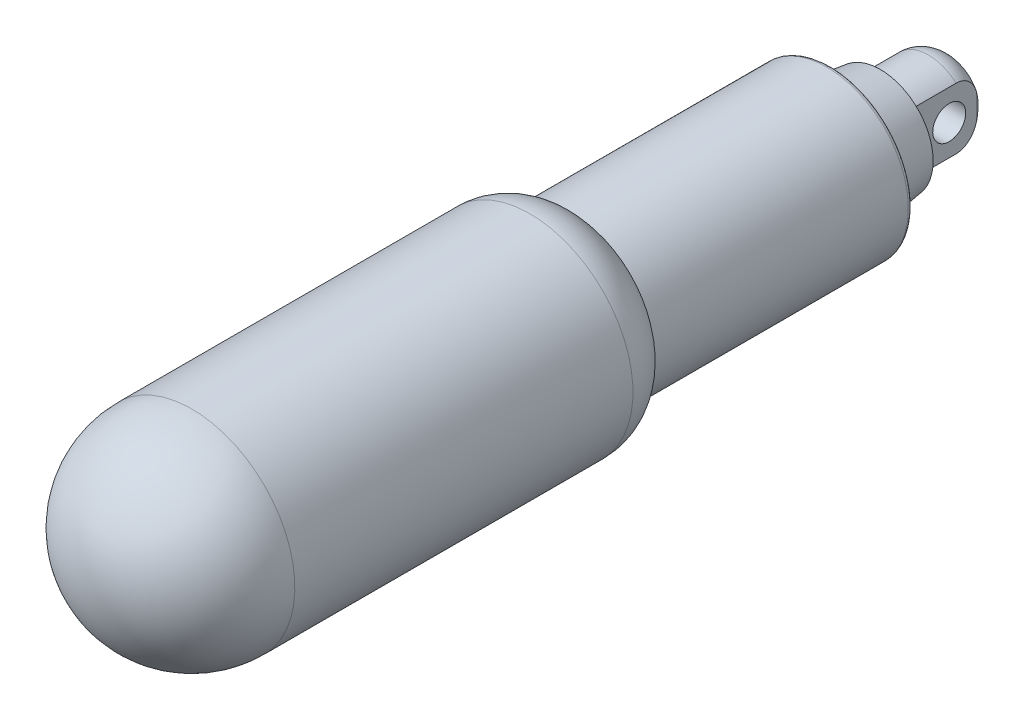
ISO-10303-21;
HEADER;
FILE_DESCRIPTION(('STEP AP214'),'2;1');
FILE_NAME('part.step','',(''),(''),'','','');
FILE_SCHEMA(('AUTOMOTIVE_DESIGN { 1 0 10303 214 1 1 1 1 }'));
ENDSEC;
DATA;
#1=APPLICATION_CONTEXT('core data for automotive mechanical design processes');
#2=APPLICATION_PROTOCOL_DEFINITION('international standard','automotive_design',2000,#1);
#3=PRODUCT_CONTEXT('',#1,'mechanical');
#4=PRODUCT('Part','Part','',(#3));
#5=PRODUCT_RELATED_PRODUCT_CATEGORY('part','',(#4));
#6=PRODUCT_DEFINITION_FORMATION('','',#4);
#7=PRODUCT_DEFINITION_CONTEXT('part definition',#1,'design');
#8=PRODUCT_DEFINITION('design','',#6,#7);
#9=PRODUCT_DEFINITION_SHAPE('','',#8);
#10=(LENGTH_UNIT() NAMED_UNIT(*) SI_UNIT(.MILLI.,.METRE.));
#11=(NAMED_UNIT(*) PLANE_ANGLE_UNIT() SI_UNIT($,.RADIAN.));
#12=(NAMED_UNIT(*) SI_UNIT($,.STERADIAN.) SOLID_ANGLE_UNIT());
#13=UNCERTAINTY_MEASURE_WITH_UNIT(LENGTH_MEASURE(1.E-05),#10,'distance_accuracy_value','');
#14=(GEOMETRIC_REPRESENTATION_CONTEXT(3) GLOBAL_UNCERTAINTY_ASSIGNED_CONTEXT((#13)) GLOBAL_UNIT_ASSIGNED_CONTEXT((#10,
#11,#12)) REPRESENTATION_CONTEXT('',''));
#15=CARTESIAN_POINT('',(0.,0.,0.));
#16=DIRECTION('',(0.,0.,1.));
#17=DIRECTION('',(1.,0.,0.));
#18=AXIS2_PLACEMENT_3D('',#15,#16,#17);
#19=CARTESIAN_POINT('',(0.,1.,-3.8333333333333));
#20=DIRECTION('',(0.,0.,-1.));
#21=DIRECTION('',(0.,1.,0.));
#22=AXIS2_PLACEMENT_3D('',#19,#20,#21);
#23=PLANE('',#22);
#24=CARTESIAN_POINT('',(0.,0.,-3.8333333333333));
#25=DIRECTION('',(0.,0.,1.));
#26=DIRECTION('',(1.,0.,0.));
#27=AXIS2_PLACEMENT_3D('',#24,#25,#26);
#28=CIRCLE('',#27,2.);
#29=CARTESIAN_POINT('',(2.,0.,-3.8333333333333));
#30=VERTEX_POINT('',#29);
#31=CARTESIAN_POINT('',(0.,2.,-3.8333333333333));
#32=VERTEX_POINT('',#31);
#33=EDGE_CURVE('E186',#30,#32,#28,.T.);
#34=ORIENTED_EDGE('',*,*,#33,.F.);
#35=CARTESIAN_POINT('',(0.,0.,-3.8333333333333));
#36=DIRECTION('',(0.,0.,1.));
#37=DIRECTION('',(-1.,0.,0.));
#38=AXIS2_PLACEMENT_3D('',#35,#36,#37);
#39=CIRCLE('',#38,2.);
#40=CARTESIAN_POINT('',(-2.,0.,-3.8333333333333));
#41=VERTEX_POINT('',#40);
#42=EDGE_CURVE('E81',#41,#30,#39,.T.);
#43=ORIENTED_EDGE('',*,*,#42,.F.);
#44=CARTESIAN_POINT('',(0.,0.,-3.8333333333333));
#45=DIRECTION('',(0.,0.,1.));
#46=DIRECTION('',(0.,1.,0.));
#47=AXIS2_PLACEMENT_3D('',#44,#45,#46);
#48=CIRCLE('',#47,2.);
#49=EDGE_CURVE('E182',#32,#41,#48,.T.);
#50=ORIENTED_EDGE('',*,*,#49,.F.);
#51=EDGE_LOOP('',(#34,#43,#50));
#52=FACE_BOUND('',#51,.T.);
#53=ADVANCED_FACE('F14',(#52),#23,.T.);
#54=CARTESIAN_POINT('',(-2.85,-12.5,-3.3333333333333));
#55=DIRECTION('',(0.,-1.,0.));
#56=DIRECTION('',(1.,0.,0.));
#57=AXIS2_PLACEMENT_3D('',#54,#55,#56);
#58=CYLINDRICAL_SURFACE('',#57,0.5);
#59=DIRECTION('',(0.,1.,0.));
#60=VECTOR('',#59,1.);
#61=CARTESIAN_POINT('',(-3.35,-12.5,-3.3333333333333));
#62=LINE('',#61,#60);
#63=CARTESIAN_POINT('',(-3.35,-1.46994883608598,-3.3333333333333));
#64=VERTEX_POINT('',#63);
#65=CARTESIAN_POINT('',(-3.35,1.469948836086,-3.3333333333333));
#66=VERTEX_POINT('',#65);
#67=EDGE_CURVE('E112',#64,#66,#62,.T.);
#68=ORIENTED_EDGE('',*,*,#67,.T.);
#69=CARTESIAN_POINT('',(-3.35,-1.46994883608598,-3.3333333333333));
#70=CARTESIAN_POINT('',(-3.34998929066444,-1.38900390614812,-3.35493138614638));
#71=CARTESIAN_POINT('',(-3.34860257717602,-1.30767154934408,-3.37502525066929));
#72=CARTESIAN_POINT('',(-3.34413889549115,-1.14428987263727,-3.41190932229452));
#73=CARTESIAN_POINT('',(-3.34106162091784,-1.06224042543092,-3.42869892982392));
#74=CARTESIAN_POINT('',(-3.33428000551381,-0.897527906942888,-3.45866823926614));
#75=CARTESIAN_POINT('',(-3.33057578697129,-0.81486495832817,-3.47184864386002));
#76=CARTESIAN_POINT('',(-3.32348196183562,-0.649026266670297,-3.49444080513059));
#77=CARTESIAN_POINT('',(-3.32009229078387,-0.565850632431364,-3.50385333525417));
#78=CARTESIAN_POINT('',(-3.31450016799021,-0.402301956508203,-3.51853373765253));
#79=CARTESIAN_POINT('',(-3.31225727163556,-0.321943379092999,-3.52394634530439));
#80=CARTESIAN_POINT('',(-3.30921472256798,-0.161056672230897,-3.53116512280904));
#81=CARTESIAN_POINT('',(-3.30841468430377,-0.0805285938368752,-3.53297225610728));
#82=CARTESIAN_POINT('',(-3.30841532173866,0.0838132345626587,-3.53297221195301));
#83=CARTESIAN_POINT('',(-3.30928261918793,0.167627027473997,-3.53101460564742));
#84=CARTESIAN_POINT('',(-3.31256869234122,0.335052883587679,-3.52319581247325));
#85=CARTESIAN_POINT('',(-3.31498772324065,0.41866491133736,-3.5173339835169));
#86=CARTESIAN_POINT('',(-3.32085766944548,0.585559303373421,-3.50174352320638));
#87=CARTESIAN_POINT('',(-3.32430945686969,0.668841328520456,-3.49201162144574));
#88=CARTESIAN_POINT('',(-3.33145710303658,0.83485531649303,-3.46878134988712));
#89=CARTESIAN_POINT('',(-3.33515293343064,0.917587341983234,-3.45528341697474));
#90=CARTESIAN_POINT('',(-3.34169421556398,1.07900850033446,-3.42532265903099));
#91=CARTESIAN_POINT('',(-3.34456848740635,1.1577234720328,-3.40900533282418));
#92=CARTESIAN_POINT('',(-3.34871587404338,1.31439309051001,-3.37336000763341));
#93=CARTESIAN_POINT('',(-3.34999123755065,1.39234865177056,-3.35403627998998));
#94=CARTESIAN_POINT('',(-3.35,1.469948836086,-3.3333333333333));
#95=B_SPLINE_CURVE_WITH_KNOTS('',3,(#69,#70,#71,#72,#73,#74,#75,#76,#77,#78,#79,#80,#81,#82,#83,
#84,#85,#86,#87,#88,#89,#90,#91,#92,#93,#94),.UNSPECIFIED.,.F.,.F.,(4,2,2,2,2,2,2,2,2,2,2,2,4),
(0.,0.25128846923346,0.502622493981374,0.753907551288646,1.00514099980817,1.24676672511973,
1.48832787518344,1.73974194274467,1.99119736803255,2.24286573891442,2.49450492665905,
2.73574984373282,2.97665509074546),.UNSPECIFIED.);
#96=EDGE_CURVE('E80',#64,#66,#95,.T.);
#97=ORIENTED_EDGE('',*,*,#96,.F.);
#98=EDGE_LOOP('',(#68,#97));
#99=FACE_BOUND('',#98,.T.);
#100=ADVANCED_FACE('F227',(#99),#58,.T.);
#101=CARTESIAN_POINT('',(12.5,0.,0.));
#102=DIRECTION('',(1.,0.,0.));
#103=DIRECTION('',(0.,1.,0.));
#104=AXIS2_PLACEMENT_3D('',#101,#102,#103);
#105=CYLINDRICAL_SURFACE('',#104,2.);
#106=CARTESIAN_POINT('',(3.35,0.,0.));
#107=DIRECTION('',(1.,0.,0.));
#108=DIRECTION('',(0.,1.,0.));
#109=AXIS2_PLACEMENT_3D('',#106,#107,#108);
#110=CIRCLE('',#109,2.);
#111=CARTESIAN_POINT('',(3.35,2.,0.));
#112=VERTEX_POINT('',#111);
#113=EDGE_CURVE('E92',#112,#112,#110,.T.);
#114=ORIENTED_EDGE('',*,*,#113,.T.);
#115=EDGE_LOOP('',(#114));
#116=FACE_BOUND('',#115,.T.);
#117=CARTESIAN_POINT('',(-3.35,0.,0.));
#118=DIRECTION('',(1.,0.,0.));
#119=DIRECTION('',(0.,1.,0.));
#120=AXIS2_PLACEMENT_3D('',#117,#118,#119);
#121=CIRCLE('',#120,2.);
#122=CARTESIAN_POINT('',(-3.35,2.,0.));
#123=VERTEX_POINT('',#122);
#124=EDGE_CURVE('E218',#123,#123,#121,.F.);
#125=ORIENTED_EDGE('',*,*,#124,.T.);
#126=EDGE_LOOP('',(#125));
#127=FACE_BOUND('',#126,.T.);
#128=ADVANCED_FACE('F241',(#116,#127),#105,.F.);
#129=CARTESIAN_POINT('',(2.85,-12.5,-3.3333333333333));
#130=DIRECTION('',(0.,-1.,0.));
#131=DIRECTION('',(1.,0.,0.));
#132=AXIS2_PLACEMENT_3D('',#129,#130,#131);
#133=CYLINDRICAL_SURFACE('',#132,0.5);
#134=DIRECTION('',(0.,1.,0.));
#135=VECTOR('',#134,1.);
#136=CARTESIAN_POINT('',(3.35,-12.5,-3.3333333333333));
#137=LINE('',#136,#135);
#138=CARTESIAN_POINT('',(3.35,1.469948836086,-3.3333333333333));
#139=VERTEX_POINT('',#138);
#140=CARTESIAN_POINT('',(3.35,-1.46994883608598,-3.3333333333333));
#141=VERTEX_POINT('',#140);
#142=EDGE_CURVE('E77',#139,#141,#137,.F.);
#143=ORIENTED_EDGE('',*,*,#142,.T.);
#144=CARTESIAN_POINT('',(3.35,1.469948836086,-3.3333333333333));
#145=CARTESIAN_POINT('',(3.34998929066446,1.38900390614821,-3.35493138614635));
#146=CARTESIAN_POINT('',(3.34860257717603,1.30767154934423,-3.37502525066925));
#147=CARTESIAN_POINT('',(3.34413889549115,1.14428987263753,-3.41190932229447));
#148=CARTESIAN_POINT('',(3.34106162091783,1.06224042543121,-3.42869892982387));
#149=CARTESIAN_POINT('',(3.33428000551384,0.897527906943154,-3.45866823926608));
#150=CARTESIAN_POINT('',(3.33057578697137,0.814864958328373,-3.47184864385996));
#151=CARTESIAN_POINT('',(3.32348196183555,0.649026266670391,-3.49444080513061));
#152=CARTESIAN_POINT('',(3.32009229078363,0.565850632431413,-3.50385333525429));
#153=CARTESIAN_POINT('',(3.31450016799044,0.402301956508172,-3.51853373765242));
#154=CARTESIAN_POINT('',(3.3122572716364,0.321943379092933,-3.52394634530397));
#155=CARTESIAN_POINT('',(3.30921472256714,0.16105667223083,-3.53116512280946));
#156=CARTESIAN_POINT('',(3.30841468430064,0.0805285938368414,-3.53297225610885));
#157=CARTESIAN_POINT('',(3.30841532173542,-0.0838132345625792,-3.53297221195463));
#158=CARTESIAN_POINT('',(3.30928261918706,-0.167627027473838,-3.53101460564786));
#159=CARTESIAN_POINT('',(3.31256869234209,-0.335052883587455,-3.52319581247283));
#160=CARTESIAN_POINT('',(3.31498772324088,-0.41866491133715,-3.51733398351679));
#161=CARTESIAN_POINT('',(3.32085766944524,-0.585559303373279,-3.50174352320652));
#162=CARTESIAN_POINT('',(3.32430945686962,-0.668841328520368,-3.49201162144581));
#163=CARTESIAN_POINT('',(3.33145710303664,-0.834855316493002,-3.46878134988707));
#164=CARTESIAN_POINT('',(3.33515293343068,-0.917587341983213,-3.45528341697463));
#165=CARTESIAN_POINT('',(3.34169421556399,-1.07900850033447,-3.42532265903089));
#166=CARTESIAN_POINT('',(3.34456848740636,-1.15772347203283,-3.40900533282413));
#167=CARTESIAN_POINT('',(3.34871587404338,-1.31439309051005,-3.37336000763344));
#168=CARTESIAN_POINT('',(3.34999123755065,-1.39234865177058,-3.35403627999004));
#169=CARTESIAN_POINT('',(3.35,-1.46994883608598,-3.3333333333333));
#170=B_SPLINE_CURVE_WITH_KNOTS('',3,(#144,#145,#146,#147,#148,#149,#150,#151,#152,#153,#154,
#155,#156,#157,#158,#159,#160,#161,#162,#163,#164,#165,#166,#167,#168,#169),.UNSPECIFIED.,.F.,
.F.,(4,2,2,2,2,2,2,2,2,2,2,2,4),(0.,0.25128846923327,0.502622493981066,0.753907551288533,
1.0051409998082,1.24676672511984,1.48832787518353,1.73974194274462,1.99119736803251,
2.24286573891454,2.49450492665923,2.73574984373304,2.97665509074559),.UNSPECIFIED.);
#171=EDGE_CURVE('E73',#139,#141,#170,.T.);
#172=ORIENTED_EDGE('',*,*,#171,.F.);
#173=EDGE_LOOP('',(#143,#172));
#174=FACE_BOUND('',#173,.T.);
#175=ADVANCED_FACE('F75',(#174),#133,.T.);
#176=CARTESIAN_POINT('',(-2.,0.,-0.833333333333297));
#177=DIRECTION('',(0.,-1.,0.));
#178=DIRECTION('',(-1.,0.,0.));
#179=AXIS2_PLACEMENT_3D('',#176,#177,#178);
#180=CIRCLE('',#179,3.);
#181=TRIMMED_CURVE('',#180,(PARAMETER_VALUE(-2.30052398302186)),
(PARAMETER_VALUE(2.30052398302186)),.T.,.PARAMETER.);
#182=CARTESIAN_POINT('',(0.,0.,-0.833333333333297));
#183=DIRECTION('',(0.,0.,1.));
#184=AXIS1_PLACEMENT('',#182,#183);
#185=SURFACE_OF_REVOLUTION('',#181,#184);
#186=ORIENTED_EDGE('',*,*,#49,.T.);
#187=ORIENTED_EDGE('',*,*,#42,.T.);
#188=ORIENTED_EDGE('',*,*,#33,.T.);
#189=EDGE_LOOP('',(#186,#187,#188));
#190=FACE_BOUND('',#189,.T.);
#191=CARTESIAN_POINT('',(-3.35,-3.71180549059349,-0.833333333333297));
#192=CARTESIAN_POINT('',(-3.35,-3.71181699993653,-0.898983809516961));
#193=CARTESIAN_POINT('',(-3.35,-3.70890287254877,-0.964628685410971));
#194=CARTESIAN_POINT('',(-3.35,-3.69731152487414,-1.09539068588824));
#195=CARTESIAN_POINT('',(-3.35,-3.68863583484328,-1.16050794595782));
#196=CARTESIAN_POINT('',(-3.35,-3.66564391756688,-1.28954015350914));
#197=CARTESIAN_POINT('',(-3.35,-3.65134465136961,-1.35345811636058));
#198=CARTESIAN_POINT('',(-3.35,-3.61728742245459,-1.47980535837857));
#199=CARTESIAN_POINT('',(-3.35,-3.59752931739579,-1.54223459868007));
#200=CARTESIAN_POINT('',(-3.35,-3.53039604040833,-1.72655798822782));
#201=CARTESIAN_POINT('',(-3.35,-3.4751282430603,-1.8456731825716));
#202=CARTESIAN_POINT('',(-3.35,-3.3460152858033,-2.073150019));
#203=CARTESIAN_POINT('',(-3.35,-3.27217686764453,-2.18151554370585));
#204=CARTESIAN_POINT('',(-3.35,-3.10638007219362,-2.3885727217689));
#205=CARTESIAN_POINT('',(-3.35,-3.01395529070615,-2.4868892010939));
#206=CARTESIAN_POINT('',(-3.35,-2.81547339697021,-2.6691608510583));
#207=CARTESIAN_POINT('',(-3.35,-2.7093763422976,-2.75307219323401));
#208=CARTESIAN_POINT('',(-3.35,-2.51267240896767,-2.88832802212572));
#209=CARTESIAN_POINT('',(-3.35,-2.42412552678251,-2.94272212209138));
#210=CARTESIAN_POINT('',(-3.35,-2.24220900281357,-3.04298080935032));
#211=CARTESIAN_POINT('',(-3.35,-2.14883402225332,-3.08883568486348));
#212=CARTESIAN_POINT('',(-3.35,-1.95916659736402,-3.17209275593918));
#213=CARTESIAN_POINT('',(-3.35,-1.86289751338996,-3.20954881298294));
#214=CARTESIAN_POINT('',(-3.35,-1.66801090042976,-3.27690781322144));
#215=CARTESIAN_POINT('',(-3.35,-1.56939985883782,-3.30682944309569));
#216=CARTESIAN_POINT('',(-3.35,-1.46994883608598,-3.3333333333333));
#217=B_SPLINE_CURVE_WITH_KNOTS('',3,(#191,#192,#193,#194,#195,#196,#197,#198,#199,#200,#201,
#202,#203,#204,#205,#206,#207,#208,#209,#210,#211,#212,#213,#214,#215,#216),.UNSPECIFIED.,.F.,
.F.,(4,2,2,2,2,2,2,2,2,2,2,2,4),(0.,0.196877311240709,0.393702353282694,0.589938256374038,
0.78617927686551,1.17810350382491,1.56988565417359,1.97311519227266,2.37755063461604,
2.6888421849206,3.00048563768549,3.31006941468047,3.61887763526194),.UNSPECIFIED.);
#218=CARTESIAN_POINT('',(-3.35000000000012,-3.71180549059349,-0.833333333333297));
#219=VERTEX_POINT('',#218);
#220=EDGE_CURVE('E115',#219,#64,#217,.T.);
#221=ORIENTED_EDGE('',*,*,#220,.T.);
#222=ORIENTED_EDGE('',*,*,#96,.T.);
#223=CARTESIAN_POINT('',(-3.35,1.469948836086,-3.3333333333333));
#224=CARTESIAN_POINT('',(-3.35,1.57131407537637,-3.30631962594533));
#225=CARTESIAN_POINT('',(-3.35,1.6718090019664,-3.27575414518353));
#226=CARTESIAN_POINT('',(-3.35,1.87035880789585,-3.20680122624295));
#227=CARTESIAN_POINT('',(-3.35,1.96840666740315,-3.16839366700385));
#228=CARTESIAN_POINT('',(-3.35,2.16161176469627,-3.0828240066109));
#229=CARTESIAN_POINT('',(-3.35,2.25673885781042,-3.03559297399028));
#230=CARTESIAN_POINT('',(-3.35,2.44187911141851,-2.93220009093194));
#231=CARTESIAN_POINT('',(-3.34999999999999,2.53189790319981,-2.87604834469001));
#232=CARTESIAN_POINT('',(-3.35000000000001,2.74020068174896,-2.73026422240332));
#233=CARTESIAN_POINT('',(-3.35000000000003,2.85545027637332,-2.63620758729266));
#234=CARTESIAN_POINT('',(-3.34999999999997,3.06877640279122,-2.43070307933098));
#235=CARTESIAN_POINT('',(-3.34999999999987,3.16690835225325,-2.31931362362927));
#236=CARTESIAN_POINT('',(-3.34999999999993,3.29852465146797,-2.1401699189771));
#237=CARTESIAN_POINT('',(-3.34999999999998,3.33994980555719,-2.07814013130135));
#238=CARTESIAN_POINT('',(-3.35000000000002,3.41690061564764,-1.95053694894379));
#239=CARTESIAN_POINT('',(-3.35,3.45242904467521,-1.88496523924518));
#240=CARTESIAN_POINT('',(-3.35,3.51712122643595,-1.75072528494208));
#241=CARTESIAN_POINT('',(-3.35000000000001,3.54628310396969,-1.68205613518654));
#242=CARTESIAN_POINT('',(-3.34999999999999,3.59780943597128,-1.54224910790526));
#243=CARTESIAN_POINT('',(-3.34999999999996,3.62017631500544,-1.4711121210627));
#244=CARTESIAN_POINT('',(-3.34999999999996,3.66306023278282,-1.30676769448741));
#245=CARTESIAN_POINT('',(-3.34999999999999,3.68131096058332,-1.21295123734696));
#246=CARTESIAN_POINT('',(-3.35,3.69959048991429,-1.07115023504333));
#247=CARTESIAN_POINT('',(-3.35,3.70416757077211,-1.0237068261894));
#248=CARTESIAN_POINT('',(-3.35,3.7102751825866,-0.928625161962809));
#249=CARTESIAN_POINT('',(-3.35,3.71180576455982,-0.880986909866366));
#250=CARTESIAN_POINT('',(-3.35,3.71180549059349,-0.833333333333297));
#251=B_SPLINE_CURVE_WITH_KNOTS('',3,(#223,#224,#225,#226,#227,#228,#229,#230,#231,#232,#233,
#234,#235,#236,#237,#238,#239,#240,#241,#242,#243,#244,#245,#246,#247,#248,#249,#250),
.UNSPECIFIED.,.F.,.F.,(4,2,2,2,2,2,2,2,2,2,2,2,2,4),(0.,0.31475508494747,0.630328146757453,
0.948478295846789,1.26627062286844,1.710724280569,2.15371119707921,2.37721575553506,
2.6006149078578,2.82407977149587,3.04746480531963,3.33331667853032,3.47622487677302,
3.61913068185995),.UNSPECIFIED.);
#252=CARTESIAN_POINT('',(-3.35,3.71180549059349,-0.833333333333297));
#253=VERTEX_POINT('',#252);
#254=EDGE_CURVE('E111',#66,#253,#251,.T.);
#255=ORIENTED_EDGE('',*,*,#254,.T.);
#256=CARTESIAN_POINT('',(0.,0.,-0.833333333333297));
#257=DIRECTION('',(0.,0.,-1.));
#258=DIRECTION('',(-1.,0.,0.));
#259=AXIS2_PLACEMENT_3D('',#256,#257,#258);
#260=CIRCLE('',#259,5.);
#261=CARTESIAN_POINT('',(3.35,3.71180549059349,-0.833333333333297));
#262=VERTEX_POINT('',#261);
#263=EDGE_CURVE('E88',#262,#253,#260,.F.);
#264=ORIENTED_EDGE('',*,*,#263,.F.);
#265=CARTESIAN_POINT('',(3.35,3.71180549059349,-0.833333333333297));
#266=CARTESIAN_POINT('',(3.35,3.71181699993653,-0.89898380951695));
#267=CARTESIAN_POINT('',(3.35,3.70890287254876,-0.964628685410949));
#268=CARTESIAN_POINT('',(3.35,3.69731152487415,-1.0953906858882));
#269=CARTESIAN_POINT('',(3.35,3.68863583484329,-1.16050794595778));
#270=CARTESIAN_POINT('',(3.35,3.66564391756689,-1.2895401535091));
#271=CARTESIAN_POINT('',(3.35,3.65134465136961,-1.35345811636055));
#272=CARTESIAN_POINT('',(3.35,3.6172874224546,-1.47980535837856));
#273=CARTESIAN_POINT('',(3.35,3.5975293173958,-1.54223459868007));
#274=CARTESIAN_POINT('',(3.35,3.53039604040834,-1.72655798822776));
#275=CARTESIAN_POINT('',(3.35,3.47512824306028,-1.84567318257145));
#276=CARTESIAN_POINT('',(3.35,3.34601528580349,-2.07315001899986));
#277=CARTESIAN_POINT('',(3.35,3.27217686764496,-2.1815155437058));
#278=CARTESIAN_POINT('',(3.35,3.10638007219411,-2.38857272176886));
#279=CARTESIAN_POINT('',(3.35,3.01395529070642,-2.48688920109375));
#280=CARTESIAN_POINT('',(3.35,2.81547339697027,-2.66916085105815));
#281=CARTESIAN_POINT('',(3.35,2.70937634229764,-2.75307219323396));
#282=CARTESIAN_POINT('',(3.35,2.51267240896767,-2.88832802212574));
#283=CARTESIAN_POINT('',(3.35,2.42412552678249,-2.9427221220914));
#284=CARTESIAN_POINT('',(3.35,2.24220900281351,-3.04298080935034));
#285=CARTESIAN_POINT('',(3.35,2.14883402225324,-3.08883568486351));
#286=CARTESIAN_POINT('',(3.35,1.95916659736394,-3.17209275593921));
#287=CARTESIAN_POINT('',(3.35,1.86289751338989,-3.20954881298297));
#288=CARTESIAN_POINT('',(3.35,1.66801090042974,-3.27690781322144));
#289=CARTESIAN_POINT('',(3.35,1.56939985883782,-3.30682944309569));
#290=CARTESIAN_POINT('',(3.35,1.469948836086,-3.3333333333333));
#291=B_SPLINE_CURVE_WITH_KNOTS('',3,(#265,#266,#267,#268,#269,#270,#271,#272,#273,#274,#275,
#276,#277,#278,#279,#280,#281,#282,#283,#284,#285,#286,#287,#288,#289,#290),.UNSPECIFIED.,.F.,
.F.,(4,2,2,2,2,2,2,2,2,2,2,2,4),(0.,0.196877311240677,0.393702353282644,0.589938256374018,
0.78617927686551,1.17810350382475,1.56988565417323,1.97311519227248,2.37755063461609,
2.68884218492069,3.00048563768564,3.31006941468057,3.61887763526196),.UNSPECIFIED.);
#292=EDGE_CURVE('E84',#262,#139,#291,.T.);
#293=ORIENTED_EDGE('',*,*,#292,.T.);
#294=ORIENTED_EDGE('',*,*,#171,.T.);
#295=CARTESIAN_POINT('',(3.35,-1.46994883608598,-3.3333333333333));
#296=CARTESIAN_POINT('',(3.35,-1.57131407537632,-3.30631962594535));
#297=CARTESIAN_POINT('',(3.35,-1.6718090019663,-3.27575414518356));
#298=CARTESIAN_POINT('',(3.35,-1.87035880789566,-3.20680122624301));
#299=CARTESIAN_POINT('',(3.35,-1.96840666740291,-3.16839366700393));
#300=CARTESIAN_POINT('',(3.35,-2.16161176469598,-3.08282400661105));
#301=CARTESIAN_POINT('',(3.35,-2.25673885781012,-3.03559297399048));
#302=CARTESIAN_POINT('',(3.35,-2.44187911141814,-2.93220009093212));
#303=CARTESIAN_POINT('',(3.34999999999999,-2.53189790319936,-2.87604834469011));
#304=CARTESIAN_POINT('',(3.35000000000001,-2.74020068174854,-2.73026422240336));
#305=CARTESIAN_POINT('',(3.35000000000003,-2.85545027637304,-2.6362075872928));
#306=CARTESIAN_POINT('',(3.34999999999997,-3.06877640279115,-2.43070307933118));
#307=CARTESIAN_POINT('',(3.34999999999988,-3.16690835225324,-2.31931362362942));
#308=CARTESIAN_POINT('',(3.34999999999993,-3.29852465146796,-2.14016991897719));
#309=CARTESIAN_POINT('',(3.34999999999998,-3.33994980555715,-2.07814013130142));
#310=CARTESIAN_POINT('',(3.35000000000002,-3.41690061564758,-1.95053694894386));
#311=CARTESIAN_POINT('',(3.35,-3.45242904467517,-1.88496523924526));
#312=CARTESIAN_POINT('',(3.35,-3.51712122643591,-1.75072528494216));
#313=CARTESIAN_POINT('',(3.35000000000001,-3.54628310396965,-1.68205613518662));
#314=CARTESIAN_POINT('',(3.34999999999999,-3.59780943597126,-1.54224910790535));
#315=CARTESIAN_POINT('',(3.34999999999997,-3.62017631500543,-1.4711121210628));
#316=CARTESIAN_POINT('',(3.34999999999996,-3.66306023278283,-1.30676769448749));
#317=CARTESIAN_POINT('',(3.34999999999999,-3.68131096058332,-1.21295123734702));
#318=CARTESIAN_POINT('',(3.35,-3.69959048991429,-1.07115023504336));
#319=CARTESIAN_POINT('',(3.35,-3.70416757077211,-1.02370682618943));
#320=CARTESIAN_POINT('',(3.35,-3.7102751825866,-0.928625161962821));
#321=CARTESIAN_POINT('',(3.35,-3.71180576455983,-0.880986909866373));
#322=CARTESIAN_POINT('',(3.35,-3.71180549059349,-0.833333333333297));
#323=B_SPLINE_CURVE_WITH_KNOTS('',3,(#295,#296,#297,#298,#299,#300,#301,#302,#303,#304,#305,
#306,#307,#308,#309,#310,#311,#312,#313,#314,#315,#316,#317,#318,#319,#320,#321,#322),
.UNSPECIFIED.,.F.,.F.,(4,2,2,2,2,2,2,2,2,2,2,2,2,4),(0.,0.314755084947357,0.630328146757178,
0.948478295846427,1.26627062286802,1.71072428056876,2.15371119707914,2.37721575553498,
2.60061490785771,2.82407977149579,3.04746480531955,3.33331667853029,3.47622487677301,
3.61913068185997),.UNSPECIFIED.);
#324=CARTESIAN_POINT('',(3.35,-3.711805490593,-0.833333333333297));
#325=VERTEX_POINT('',#324);
#326=EDGE_CURVE('E98',#141,#325,#323,.T.);
#327=ORIENTED_EDGE('',*,*,#326,.T.);
#328=CARTESIAN_POINT('',(0.,0.,-0.833333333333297));
#329=DIRECTION('',(0.,0.,-1.));
#330=DIRECTION('',(-1.,0.,0.));
#331=AXIS2_PLACEMENT_3D('',#328,#329,#330);
#332=CIRCLE('',#331,5.);
#333=EDGE_CURVE('E108',#219,#325,#332,.F.);
#334=ORIENTED_EDGE('',*,*,#333,.F.);
#335=EDGE_LOOP('',(#221,#222,#255,#264,#293,#294,#327,#334));
#336=FACE_BOUND('',#335,.T.);
#337=ADVANCED_FACE('F86',(#190,#336),#185,.F.);
#338=CARTESIAN_POINT('',(0.,0.,2.0833333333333));
#339=DIRECTION('',(0.,0.,-1.));
#340=DIRECTION('',(-1.,0.,0.));
#341=AXIS2_PLACEMENT_3D('',#338,#339,#340);
#342=CYLINDRICAL_SURFACE('',#341,5.);
#343=DIRECTION('',(0.,0.,-1.));
#344=VECTOR('',#343,1.);
#345=CARTESIAN_POINT('',(-3.35,3.711805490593,-3.3333333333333));
#346=LINE('',#345,#344);
#347=CARTESIAN_POINT('',(-3.35,3.71180549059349,5.));
#348=VERTEX_POINT('',#347);
#349=EDGE_CURVE('E109',#253,#348,#346,.F.);
#350=ORIENTED_EDGE('',*,*,#349,.T.);
#351=CARTESIAN_POINT('',(0.,0.,5.));
#352=DIRECTION('',(0.,0.,-1.));
#353=DIRECTION('',(-1.,0.,0.));
#354=AXIS2_PLACEMENT_3D('',#351,#352,#353);
#355=CIRCLE('',#354,5.);
#356=CARTESIAN_POINT('',(3.35,3.71180549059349,5.));
#357=VERTEX_POINT('',#356);
#358=EDGE_CURVE('E401',#357,#348,#355,.F.);
#359=ORIENTED_EDGE('',*,*,#358,.F.);
#360=DIRECTION('',(0.,0.,1.));
#361=VECTOR('',#360,1.);
#362=CARTESIAN_POINT('',(3.35,3.711805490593,5.));
#363=LINE('',#362,#361);
#364=EDGE_CURVE('E402',#357,#262,#363,.F.);
#365=ORIENTED_EDGE('',*,*,#364,.T.);
#366=ORIENTED_EDGE('',*,*,#263,.T.);
#367=EDGE_LOOP('',(#350,#359,#365,#366));
#368=FACE_BOUND('',#367,.T.);
#369=ADVANCED_FACE('F128',(#368),#342,.T.);
#370=CARTESIAN_POINT('',(-3.35,-12.5,-3.3333333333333));
#371=DIRECTION('',(1.,0.,0.));
#372=DIRECTION('',(0.,0.,-1.));
#373=AXIS2_PLACEMENT_3D('',#370,#371,#372);
#374=PLANE('',#373);
#375=ORIENTED_EDGE('',*,*,#254,.F.);
#376=ORIENTED_EDGE('',*,*,#67,.F.);
#377=ORIENTED_EDGE('',*,*,#220,.F.);
#378=DIRECTION('',(0.,0.,-1.));
#379=VECTOR('',#378,1.);
#380=CARTESIAN_POINT('',(-3.35000000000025,-3.71180549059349,2.0833333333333));
#381=LINE('',#380,#379);
#382=CARTESIAN_POINT('',(-3.35000000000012,-3.71180549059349,5.));
#383=VERTEX_POINT('',#382);
#384=EDGE_CURVE('E105',#383,#219,#381,.T.);
#385=ORIENTED_EDGE('',*,*,#384,.F.);
#386=DIRECTION('',(0.,1.,0.));
#387=VECTOR('',#386,1.);
#388=CARTESIAN_POINT('',(-3.35,5.7,5.));
#389=LINE('',#388,#387);
#390=EDGE_CURVE('E399',#348,#383,#389,.F.);
#391=ORIENTED_EDGE('',*,*,#390,.F.);
#392=ORIENTED_EDGE('',*,*,#349,.F.);
#393=EDGE_LOOP('',(#375,#376,#377,#385,#391,#392));
#394=FACE_BOUND('',#393,.T.);
#395=ORIENTED_EDGE('',*,*,#124,.F.);
#396=EDGE_LOOP('',(#395));
#397=FACE_BOUND('',#396,.T.);
#398=ADVANCED_FACE('F229',(#394,#397),#374,.F.);
#399=CARTESIAN_POINT('',(0.,0.,2.0833333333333));
#400=DIRECTION('',(0.,0.,-1.));
#401=DIRECTION('',(-1.,0.,0.));
#402=AXIS2_PLACEMENT_3D('',#399,#400,#401);
#403=CYLINDRICAL_SURFACE('',#402,5.);
#404=DIRECTION('',(0.,0.,1.));
#405=VECTOR('',#404,1.);
#406=CARTESIAN_POINT('',(3.35,-3.711805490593,5.));
#407=LINE('',#406,#405);
#408=CARTESIAN_POINT('',(3.35,-3.711805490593,5.));
#409=VERTEX_POINT('',#408);
#410=EDGE_CURVE('E100',#325,#409,#407,.T.);
#411=ORIENTED_EDGE('',*,*,#410,.T.);
#412=CARTESIAN_POINT('',(0.,0.,5.));
#413=DIRECTION('',(0.,0.,-1.));
#414=DIRECTION('',(-1.,0.,0.));
#415=AXIS2_PLACEMENT_3D('',#412,#413,#414);
#416=CIRCLE('',#415,5.);
#417=EDGE_CURVE('E398',#383,#409,#416,.F.);
#418=ORIENTED_EDGE('',*,*,#417,.F.);
#419=ORIENTED_EDGE('',*,*,#384,.T.);
#420=ORIENTED_EDGE('',*,*,#333,.T.);
#421=EDGE_LOOP('',(#411,#418,#419,#420));
#422=FACE_BOUND('',#421,.T.);
#423=ADVANCED_FACE('F251',(#422),#403,.T.);
#424=CARTESIAN_POINT('',(3.35,-12.5,5.));
#425=DIRECTION('',(-1.,0.,0.));
#426=DIRECTION('',(0.,0.,1.));
#427=AXIS2_PLACEMENT_3D('',#424,#425,#426);
#428=PLANE('',#427);
#429=DIRECTION('',(0.,1.,0.));
#430=VECTOR('',#429,1.);
#431=CARTESIAN_POINT('',(3.35,5.7,5.));
#432=LINE('',#431,#430);
#433=EDGE_CURVE('E395',#409,#357,#432,.T.);
#434=ORIENTED_EDGE('',*,*,#433,.F.);
#435=ORIENTED_EDGE('',*,*,#410,.F.);
#436=ORIENTED_EDGE('',*,*,#326,.F.);
#437=ORIENTED_EDGE('',*,*,#142,.F.);
#438=ORIENTED_EDGE('',*,*,#292,.F.);
#439=ORIENTED_EDGE('',*,*,#364,.F.);
#440=EDGE_LOOP('',(#434,#435,#436,#437,#438,#439));
#441=FACE_BOUND('',#440,.T.);
#442=ORIENTED_EDGE('',*,*,#113,.F.);
#443=EDGE_LOOP('',(#442));
#444=FACE_BOUND('',#443,.T.);
#445=ADVANCED_FACE('F95',(#441,#444),#428,.F.);
#446=CARTESIAN_POINT('',(0.,5.7,5.));
#447=DIRECTION('',(0.,0.,-1.));
#448=DIRECTION('',(-1.,0.,0.));
#449=AXIS2_PLACEMENT_3D('',#446,#447,#448);
#450=PLANE('',#449);
#451=CARTESIAN_POINT('',(0.,0.,5.00000000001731));
#452=DIRECTION('',(0.,0.,1.));
#453=DIRECTION('',(1.,0.,0.));
#454=AXIS2_PLACEMENT_3D('',#451,#452,#453);
#455=CIRCLE('',#454,6.40000000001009);
#456=CARTESIAN_POINT('',(6.40000000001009,0.,5.00000000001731));
#457=VERTEX_POINT('',#456);
#458=EDGE_CURVE('E394',#457,#457,#455,.T.);
#459=ORIENTED_EDGE('',*,*,#458,.F.);
#460=EDGE_LOOP('',(#459));
#461=FACE_BOUND('',#460,.T.);
#462=ORIENTED_EDGE('',*,*,#417,.T.);
#463=ORIENTED_EDGE('',*,*,#433,.T.);
#464=ORIENTED_EDGE('',*,*,#358,.T.);
#465=ORIENTED_EDGE('',*,*,#390,.T.);
#466=EDGE_LOOP('',(#462,#463,#464,#465));
#467=FACE_BOUND('',#466,.T.);
#468=ADVANCED_FACE('F250',(#461,#467),#450,.T.);
#469=CARTESIAN_POINT('',(0.,0.,9.95566924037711));
#470=DIRECTION('',(0.,0.,1.));
#471=DIRECTION('',(1.,0.,0.));
#472=AXIS2_PLACEMENT_3D('',#469,#470,#471);
#473=CONICAL_SURFACE('',#472,7.09647389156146,0.139626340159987);
#474=CARTESIAN_POINT('',(0.,0.,9.9556692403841));
#475=DIRECTION('',(0.,0.,1.));
#476=DIRECTION('',(-1.,0.,0.));
#477=AXIS2_PLACEMENT_3D('',#474,#475,#476);
#478=CIRCLE('',#477,7.09647389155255);
#479=CARTESIAN_POINT('',(-7.09647389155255,0.,9.9556692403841));
#480=VERTEX_POINT('',#479);
#481=EDGE_CURVE('E386',#480,#480,#478,.F.);
#482=ORIENTED_EDGE('',*,*,#481,.T.);
#483=EDGE_LOOP('',(#482));
#484=FACE_BOUND('',#483,.T.);
#485=ORIENTED_EDGE('',*,*,#458,.T.);
#486=EDGE_LOOP('',(#485));
#487=FACE_BOUND('',#486,.T.);
#488=ADVANCED_FACE('F358',(#484,#487),#473,.T.);
#489=CARTESIAN_POINT('',(0.,0.,9.9));
#490=DIRECTION('',(0.,0.,1.));
#491=DIRECTION('',(-1.,0.,0.));
#492=AXIS2_PLACEMENT_3D('',#489,#490,#491);
#493=TOROIDAL_SURFACE('',#492,7.49258111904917,0.4);
#494=ORIENTED_EDGE('',*,*,#481,.F.);
#495=EDGE_LOOP('',(#494));
#496=FACE_BOUND('',#495,.T.);
#497=CARTESIAN_POINT('',(0.,0.,10.3));
#498=DIRECTION('',(0.,0.,-1.));
#499=DIRECTION('',(1.,0.,0.));
#500=AXIS2_PLACEMENT_3D('',#497,#498,#499);
#501=CIRCLE('',#500,7.49258111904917);
#502=CARTESIAN_POINT('',(-7.49258111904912,0.,10.3));
#503=VERTEX_POINT('',#502);
#504=CARTESIAN_POINT('',(7.49258111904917,0.,10.3));
#505=VERTEX_POINT('',#504);
#506=EDGE_CURVE('E342',#503,#505,#501,.F.);
#507=ORIENTED_EDGE('',*,*,#506,.F.);
#508=CARTESIAN_POINT('',(0.,0.,10.3));
#509=DIRECTION('',(0.,0.,-1.));
#510=DIRECTION('',(-1.,0.,0.));
#511=AXIS2_PLACEMENT_3D('',#508,#509,#510);
#512=CIRCLE('',#511,7.49258111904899);
#513=CARTESIAN_POINT('',(0.,7.49258111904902,10.3));
#514=VERTEX_POINT('',#513);
#515=EDGE_CURVE('E382',#514,#503,#512,.F.);
#516=ORIENTED_EDGE('',*,*,#515,.F.);
#517=CARTESIAN_POINT('',(0.,0.,10.3));
#518=DIRECTION('',(0.,0.,-1.));
#519=DIRECTION('',(0.,1.,0.));
#520=AXIS2_PLACEMENT_3D('',#517,#518,#519);
#521=CIRCLE('',#520,7.49258111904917);
#522=EDGE_CURVE('E372',#505,#514,#521,.F.);
#523=ORIENTED_EDGE('',*,*,#522,.F.);
#524=EDGE_LOOP('',(#507,#516,#523));
#525=FACE_BOUND('',#524,.T.);
#526=ADVANCED_FACE('F347',(#496,#525),#493,.F.);
#527=CARTESIAN_POINT('',(0.,7.746290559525,10.3));
#528=DIRECTION('',(0.,0.,-1.));
#529=DIRECTION('',(-1.,0.,0.));
#530=AXIS2_PLACEMENT_3D('',#527,#528,#529);
#531=PLANE('',#530);
#532=ORIENTED_EDGE('',*,*,#506,.T.);
#533=ORIENTED_EDGE('',*,*,#522,.T.);
#534=ORIENTED_EDGE('',*,*,#515,.T.);
#535=EDGE_LOOP('',(#532,#533,#534));
#536=FACE_BOUND('',#535,.T.);
#537=CARTESIAN_POINT('',(0.,0.,10.3));
#538=DIRECTION('',(0.,0.,-1.));
#539=DIRECTION('',(-1.,0.,0.));
#540=AXIS2_PLACEMENT_3D('',#537,#538,#539);
#541=CIRCLE('',#540,8.);
#542=CARTESIAN_POINT('',(-8.,0.,10.3));
#543=VERTEX_POINT('',#542);
#544=EDGE_CURVE('E411',#543,#543,#541,.F.);
#545=ORIENTED_EDGE('',*,*,#544,.F.);
#546=EDGE_LOOP('',(#545));
#547=FACE_BOUND('',#546,.T.);
#548=ADVANCED_FACE('F357',(#536,#547),#531,.T.);
#549=CARTESIAN_POINT('',(0.,0.,10.65));
#550=DIRECTION('',(0.,0.,-1.));
#551=DIRECTION('',(-1.,0.,0.));
#552=AXIS2_PLACEMENT_3D('',#549,#550,#551);
#553=CYLINDRICAL_SURFACE('',#552,8.);
#554=CARTESIAN_POINT('',(0.,0.,11.));
#555=DIRECTION('',(0.,0.,-1.));
#556=DIRECTION('',(-1.,0.,0.));
#557=AXIS2_PLACEMENT_3D('',#554,#555,#556);
#558=CIRCLE('',#557,8.);
#559=CARTESIAN_POINT('',(-8.,0.,11.));
#560=VERTEX_POINT('',#559);
#561=EDGE_CURVE('E413',#560,#560,#558,.F.);
#562=ORIENTED_EDGE('',*,*,#561,.F.);
#563=EDGE_LOOP('',(#562));
#564=FACE_BOUND('',#563,.T.);
#565=ORIENTED_EDGE('',*,*,#544,.T.);
#566=EDGE_LOOP('',(#565));
#567=FACE_BOUND('',#566,.T.);
#568=ADVANCED_FACE('F452',(#564,#567),#553,.T.);
#569=CARTESIAN_POINT('',(0.,8.7,11.));
#570=DIRECTION('',(0.,0.,-1.));
#571=DIRECTION('',(0.,1.,0.));
#572=AXIS2_PLACEMENT_3D('',#569,#570,#571);
#573=PLANE('',#572);
#574=ORIENTED_EDGE('',*,*,#561,.T.);
#575=EDGE_LOOP('',(#574));
#576=FACE_BOUND('',#575,.T.);
#577=CARTESIAN_POINT('',(0.,0.,11.));
#578=DIRECTION('',(0.,0.,1.));
#579=DIRECTION('',(1.,0.,0.));
#580=AXIS2_PLACEMENT_3D('',#577,#578,#579);
#581=CIRCLE('',#580,9.4);
#582=CARTESIAN_POINT('',(9.4,0.,11.));
#583=VERTEX_POINT('',#582);
#584=CARTESIAN_POINT('',(0.,9.4,11.));
#585=VERTEX_POINT('',#584);
#586=EDGE_CURVE('E415',#583,#585,#581,.T.);
#587=ORIENTED_EDGE('',*,*,#586,.F.);
#588=CARTESIAN_POINT('',(0.,0.,11.));
#589=DIRECTION('',(0.,0.,1.));
#590=DIRECTION('',(-1.,0.,0.));
#591=AXIS2_PLACEMENT_3D('',#588,#589,#590);
#592=CIRCLE('',#591,9.4);
#593=CARTESIAN_POINT('',(-9.4,0.,11.));
#594=VERTEX_POINT('',#593);
#595=EDGE_CURVE('E291',#594,#583,#592,.T.);
#596=ORIENTED_EDGE('',*,*,#595,.F.);
#597=CARTESIAN_POINT('',(0.,0.,11.));
#598=DIRECTION('',(0.,0.,1.));
#599=DIRECTION('',(0.,1.,0.));
#600=AXIS2_PLACEMENT_3D('',#597,#598,#599);
#601=CIRCLE('',#600,9.40000000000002);
#602=EDGE_CURVE('E326',#585,#594,#601,.T.);
#603=ORIENTED_EDGE('',*,*,#602,.F.);
#604=EDGE_LOOP('',(#587,#596,#603));
#605=FACE_BOUND('',#604,.T.);
#606=ADVANCED_FACE('F302',(#576,#605),#573,.T.);
#607=CARTESIAN_POINT('',(0.,0.,11.5));
#608=DIRECTION('',(0.,0.,1.));
#609=DIRECTION('',(-1.,0.,0.));
#610=AXIS2_PLACEMENT_3D('',#607,#608,#609);
#611=TOROIDAL_SURFACE('',#610,9.4,0.5);
#612=ORIENTED_EDGE('',*,*,#602,.T.);
#613=ORIENTED_EDGE('',*,*,#595,.T.);
#614=ORIENTED_EDGE('',*,*,#586,.T.);
#615=EDGE_LOOP('',(#612,#613,#614));
#616=FACE_BOUND('',#615,.T.);
#617=CARTESIAN_POINT('',(0.,0.,11.5));
#618=DIRECTION('',(0.,0.,-1.));
#619=DIRECTION('',(-1.,0.,0.));
#620=AXIS2_PLACEMENT_3D('',#617,#618,#619);
#621=CIRCLE('',#620,9.9);
#622=CARTESIAN_POINT('',(-9.9,0.,11.5));
#623=VERTEX_POINT('',#622);
#624=EDGE_CURVE('E287',#623,#623,#621,.F.);
#625=ORIENTED_EDGE('',*,*,#624,.F.);
#626=EDGE_LOOP('',(#625));
#627=FACE_BOUND('',#626,.T.);
#628=ADVANCED_FACE('F297',(#616,#627),#611,.T.);
#629=CARTESIAN_POINT('',(0.,0.,26.9));
#630=DIRECTION('',(0.,0.,-1.));
#631=DIRECTION('',(-1.,0.,0.));
#632=AXIS2_PLACEMENT_3D('',#629,#630,#631);
#633=CYLINDRICAL_SURFACE('',#632,9.9);
#634=ORIENTED_EDGE('',*,*,#624,.T.);
#635=EDGE_LOOP('',(#634));
#636=FACE_BOUND('',#635,.T.);
#637=CARTESIAN_POINT('',(0.,0.,42.3));
#638=DIRECTION('',(0.,0.,1.));
#639=DIRECTION('',(-1.,0.,0.));
#640=AXIS2_PLACEMENT_3D('',#637,#638,#639);
#641=CIRCLE('',#640,9.9);
#642=CARTESIAN_POINT('',(-9.9,0.,42.3));
#643=VERTEX_POINT('',#642);
#644=EDGE_CURVE('E283',#643,#643,#641,.T.);
#645=ORIENTED_EDGE('',*,*,#644,.F.);
#646=EDGE_LOOP('',(#645));
#647=FACE_BOUND('',#646,.T.);
#648=ADVANCED_FACE('F301',(#636,#647),#633,.T.);
#649=CARTESIAN_POINT('',(0.,0.,88.5));
#650=DIRECTION('',(0.,0.,1.));
#651=DIRECTION('',(0.,-1.,0.));
#652=AXIS2_PLACEMENT_3D('',#649,#650,#651);
#653=SPHERICAL_SURFACE('',#652,12.5);
#654=CARTESIAN_POINT('',(0.,0.,101.));
#655=VERTEX_POINT('',#654);
#656=VERTEX_LOOP('',#655);
#657=FACE_BOUND('',#656,.T.);
#658=CARTESIAN_POINT('',(0.,0.,88.5));
#659=DIRECTION('',(0.,0.,-1.));
#660=DIRECTION('',(-1.,0.,0.));
#661=AXIS2_PLACEMENT_3D('',#658,#659,#660);
#662=CIRCLE('',#661,12.5);
#663=CARTESIAN_POINT('',(-12.5,0.,88.5));
#664=VERTEX_POINT('',#663);
#665=EDGE_CURVE('E26',#664,#664,#662,.T.);
#666=ORIENTED_EDGE('',*,*,#665,.F.);
#667=EDGE_LOOP('',(#666));
#668=FACE_BOUND('',#667,.T.);
#669=ADVANCED_FACE('F270',(#657,#668),#653,.T.);
#670=CARTESIAN_POINT('',(-6.,0.,47.5));
#671=DIRECTION('',(0.,-1.,0.));
#672=DIRECTION('',(-1.,0.,0.));
#673=AXIS2_PLACEMENT_3D('',#670,#671,#672);
#674=CIRCLE('',#673,6.5);
#675=TRIMMED_CURVE('',#674,(PARAMETER_VALUE(-2.74680153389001)),
(PARAMETER_VALUE(2.74680153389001)),.T.,.PARAMETER.);
#676=CARTESIAN_POINT('',(0.,0.,47.5));
#677=DIRECTION('',(0.,0.,1.));
#678=AXIS1_PLACEMENT('',#676,#677);
#679=SURFACE_OF_REVOLUTION('',#675,#678);
#680=CARTESIAN_POINT('',(0.,0.,47.5));
#681=DIRECTION('',(0.,0.,-1.));
#682=DIRECTION('',(-1.,0.,0.));
#683=AXIS2_PLACEMENT_3D('',#680,#681,#682);
#684=CIRCLE('',#683,12.5);
#685=CARTESIAN_POINT('',(-12.5,0.,47.5));
#686=VERTEX_POINT('',#685);
#687=EDGE_CURVE('E9',#686,#686,#684,.F.);
#688=ORIENTED_EDGE('',*,*,#687,.F.);
#689=EDGE_LOOP('',(#688));
#690=FACE_BOUND('',#689,.T.);
#691=ORIENTED_EDGE('',*,*,#644,.T.);
#692=EDGE_LOOP('',(#691));
#693=FACE_BOUND('',#692,.T.);
#694=ADVANCED_FACE('F263',(#690,#693),#679,.F.);
#695=CARTESIAN_POINT('',(0.,0.,68.));
#696=DIRECTION('',(0.,0.,-1.));
#697=DIRECTION('',(-1.,0.,0.));
#698=AXIS2_PLACEMENT_3D('',#695,#696,#697);
#699=CYLINDRICAL_SURFACE('',#698,12.5);
#700=ORIENTED_EDGE('',*,*,#665,.T.);
#701=EDGE_LOOP('',(#700));
#702=FACE_BOUND('',#701,.T.);
#703=ORIENTED_EDGE('',*,*,#687,.T.);
#704=EDGE_LOOP('',(#703));
#705=FACE_BOUND('',#704,.T.);
#706=ADVANCED_FACE('F261',(#702,#705),#699,.T.);
#707=CLOSED_SHELL('',(#53,#100,#128,#175,#337,#369,#398,#423,#445,#468,#488,#526,#548,#568,#606,
#628,#648,#669,#694,#706));
#708=MANIFOLD_SOLID_BREP('B1',#707);
#709=ADVANCED_BREP_SHAPE_REPRESENTATION('',(#18,#708),#14);
#710=SHAPE_DEFINITION_REPRESENTATION(#9,#709);
ENDSEC;
END-ISO-10303-21;
